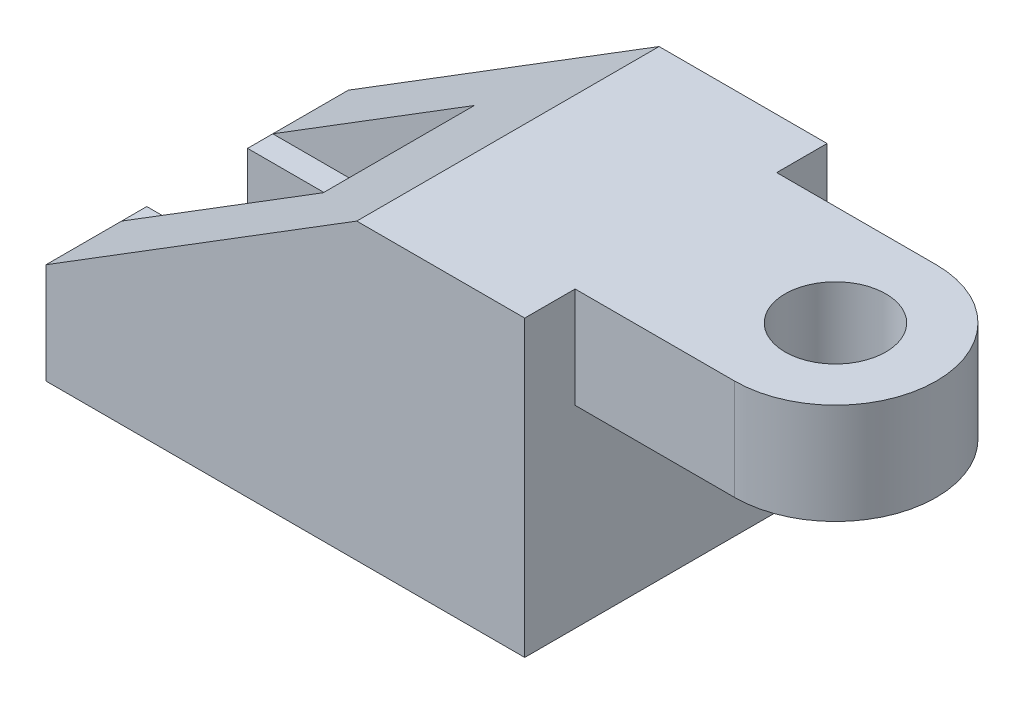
from build123d import *

# Parameters (mm, degrees)
EXTRUDE_1_DEPTH     = 18
CUT_EXTRUDE_1_DEPTH = 9
CUT_EXTRUDE_2_DEPTH = 18
SKETCH_4_R          = 6
EXTRUDE_2_DEPTH     = 12


with BuildPart() as part:
    # Sketch 1 → Extrude 1 (new, symmetric)
    with BuildSketch(Plane.XY):
        Polygon((0, 0), (-57, 0), (-57, 12), (-20, 35), (0, 35), align=None)
    extrude(amount=EXTRUDE_1_DEPTH, both=True)

    # Sketch 2 → Cut-Extrude 1 (cut, symmetric)
    with BuildSketch(Plane.XY):
        Polygon((-57, 12), (-33, 12), (-33, 26.918918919), align=None)
    extrude(amount=CUT_EXTRUDE_1_DEPTH, both=True, mode=Mode.SUBTRACT)

    # Sketch 3 → Cut-Extrude 2 (cut)
    with BuildSketch(Plane(origin=(0, 12, 0), x_dir=(1, 0, 0), z_dir=(0, 1, 0))):
        with BuildLine():
            Line((-57, 6), (-44, 6))
            ThreePointArc((-44, 6), (-38, 0), (-44, -6))
            Line((-44, -6), (-57, -6))
            Line((-57, -6), (-57, 6))
        make_face()
    extrude(amount=-CUT_EXTRUDE_2_DEPTH, mode=Mode.SUBTRACT)

    # Sketch 4 → Extrude 2 (add)
    with BuildSketch(Plane(origin=(0, 35, 0), x_dir=(1, 0, 0), z_dir=(0, 1, 0))):
        with BuildLine():
            Line((0, 12), (19, 12))
            ThreePointArc((19, 12), (31, 0), (19, -12))
            Line((19, -12), (0, -12))
            Line((0, -12), (0, 12))
        make_face()
        with Locations(Location((19, 0, 0), (0, 0, 270))):
            Circle(SKETCH_4_R, mode=Mode.SUBTRACT)
    extrude(amount=-EXTRUDE_2_DEPTH)


solid = part.part
